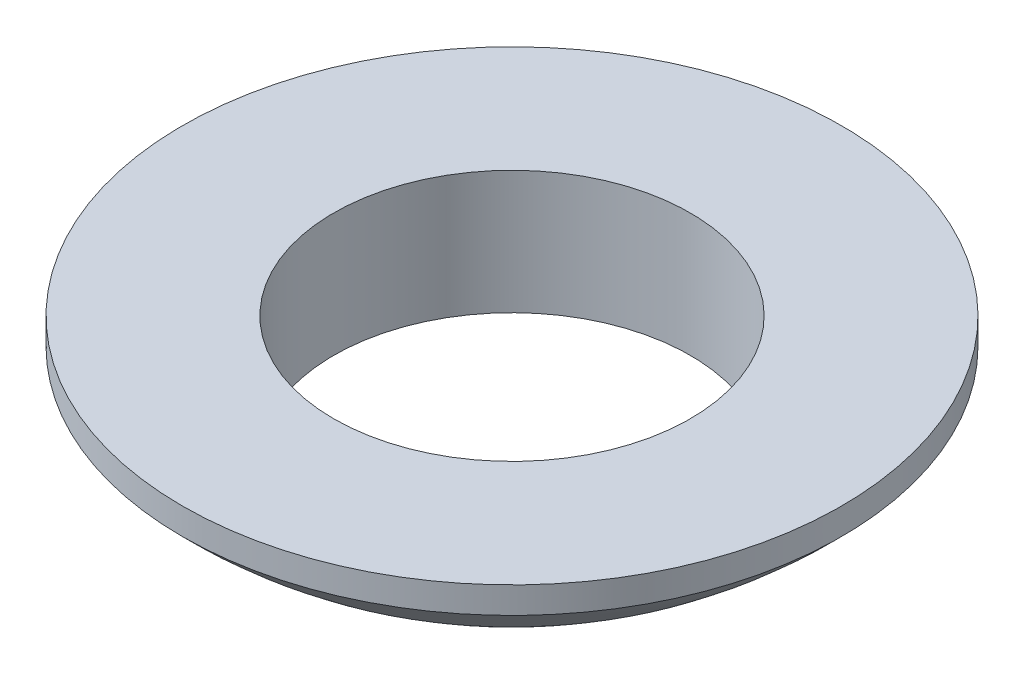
ISO-10303-21;
HEADER;
FILE_DESCRIPTION(('STEP AP214'),'2;1');
FILE_NAME('part.step','',(''),(''),'','','');
FILE_SCHEMA(('AUTOMOTIVE_DESIGN { 1 0 10303 214 1 1 1 1 }'));
ENDSEC;
DATA;
#1=APPLICATION_CONTEXT('core data for automotive mechanical design processes');
#2=APPLICATION_PROTOCOL_DEFINITION('international standard','automotive_design',2000,#1);
#3=PRODUCT_CONTEXT('',#1,'mechanical');
#4=PRODUCT('Part','Part','',(#3));
#5=PRODUCT_RELATED_PRODUCT_CATEGORY('part','',(#4));
#6=PRODUCT_DEFINITION_FORMATION('','',#4);
#7=PRODUCT_DEFINITION_CONTEXT('part definition',#1,'design');
#8=PRODUCT_DEFINITION('design','',#6,#7);
#9=PRODUCT_DEFINITION_SHAPE('','',#8);
#10=(LENGTH_UNIT() NAMED_UNIT(*) SI_UNIT(.MILLI.,.METRE.));
#11=(NAMED_UNIT(*) PLANE_ANGLE_UNIT() SI_UNIT($,.RADIAN.));
#12=(NAMED_UNIT(*) SI_UNIT($,.STERADIAN.) SOLID_ANGLE_UNIT());
#13=UNCERTAINTY_MEASURE_WITH_UNIT(LENGTH_MEASURE(1.E-05),#10,'distance_accuracy_value','');
#14=(GEOMETRIC_REPRESENTATION_CONTEXT(3) GLOBAL_UNCERTAINTY_ASSIGNED_CONTEXT((#13)) GLOBAL_UNIT_ASSIGNED_CONTEXT((#10,
#11,#12)) REPRESENTATION_CONTEXT('',''));
#15=CARTESIAN_POINT('',(0.,0.,0.));
#16=DIRECTION('',(0.,0.,1.));
#17=DIRECTION('',(1.,0.,0.));
#18=AXIS2_PLACEMENT_3D('',#15,#16,#17);
#19=CARTESIAN_POINT('',(474.940237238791,265.57848191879,0.));
#20=DIRECTION('',(0.,1.,0.));
#21=DIRECTION('',(0.,0.,1.));
#22=AXIS2_PLACEMENT_3D('',#19,#20,#21);
#23=CYLINDRICAL_SURFACE('',#22,11.7540252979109);
#24=CARTESIAN_POINT('',(474.940237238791,266.963953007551,0.));
#25=DIRECTION('',(0.,1.,0.));
#26=DIRECTION('',(0.,0.,1.));
#27=AXIS2_PLACEMENT_3D('',#24,#25,#26);
#28=CIRCLE('',#27,11.7540252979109);
#29=CARTESIAN_POINT('',(463.18621194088,266.963953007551,0.));
#30=VERTEX_POINT('',#29);
#31=EDGE_CURVE('E49',#30,#30,#28,.T.);
#32=ORIENTED_EDGE('',*,*,#31,.T.);
#33=EDGE_LOOP('',(#32));
#34=FACE_BOUND('',#33,.T.);
#35=CARTESIAN_POINT('',(474.940237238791,267.908370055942,0.));
#36=DIRECTION('',(0.,1.,0.));
#37=DIRECTION('',(0.,0.,1.));
#38=AXIS2_PLACEMENT_3D('',#35,#36,#37);
#39=CIRCLE('',#38,11.7540252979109);
#40=CARTESIAN_POINT('',(474.940237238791,267.908370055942,11.7540252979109));
#41=VERTEX_POINT('',#40);
#42=EDGE_CURVE('E10',#41,#41,#39,.T.);
#43=ORIENTED_EDGE('',*,*,#42,.F.);
#44=EDGE_LOOP('',(#43));
#45=FACE_BOUND('',#44,.T.);
#46=ADVANCED_FACE('F30',(#34,#45),#23,.T.);
#47=CARTESIAN_POINT('',(463.18621194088,267.908370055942,0.));
#48=DIRECTION('',(0.,1.,0.));
#49=DIRECTION('',(0.,0.,1.));
#50=AXIS2_PLACEMENT_3D('',#47,#48,#49);
#51=PLANE('',#50);
#52=ORIENTED_EDGE('',*,*,#42,.T.);
#53=EDGE_LOOP('',(#52));
#54=FACE_BOUND('',#53,.T.);
#55=CARTESIAN_POINT('',(474.940237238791,267.908370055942,0.));
#56=DIRECTION('',(0.,1.,0.));
#57=DIRECTION('',(0.,0.,1.));
#58=AXIS2_PLACEMENT_3D('',#55,#56,#57);
#59=CIRCLE('',#58,6.35999999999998);
#60=CARTESIAN_POINT('',(474.940237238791,267.908370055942,6.35999999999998));
#61=VERTEX_POINT('',#60);
#62=EDGE_CURVE('E36',#61,#61,#59,.T.);
#63=ORIENTED_EDGE('',*,*,#62,.F.);
#64=EDGE_LOOP('',(#63));
#65=FACE_BOUND('',#64,.T.);
#66=ADVANCED_FACE('F67',(#54,#65),#51,.T.);
#67=CARTESIAN_POINT('',(474.940237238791,265.57848191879,0.));
#68=DIRECTION('',(0.,1.,0.));
#69=DIRECTION('',(0.,0.,1.));
#70=AXIS2_PLACEMENT_3D('',#67,#68,#69);
#71=CYLINDRICAL_SURFACE('',#70,6.35999999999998);
#72=ORIENTED_EDGE('',*,*,#62,.T.);
#73=EDGE_LOOP('',(#72));
#74=FACE_BOUND('',#73,.T.);
#75=CARTESIAN_POINT('',(474.940237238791,263.508370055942,0.));
#76=DIRECTION('',(0.,1.,0.));
#77=DIRECTION('',(0.,0.,1.));
#78=AXIS2_PLACEMENT_3D('',#75,#76,#77);
#79=CIRCLE('',#78,6.35999999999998);
#80=CARTESIAN_POINT('',(474.940237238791,263.508370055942,6.35999999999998));
#81=VERTEX_POINT('',#80);
#82=EDGE_CURVE('E40',#81,#81,#79,.T.);
#83=ORIENTED_EDGE('',*,*,#82,.F.);
#84=EDGE_LOOP('',(#83));
#85=FACE_BOUND('',#84,.T.);
#86=ADVANCED_FACE('F63',(#74,#85),#71,.F.);
#87=CARTESIAN_POINT('',(467.978879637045,263.508370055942,0.));
#88=DIRECTION('',(0.,-1.,0.));
#89=DIRECTION('',(0.,0.,-1.));
#90=AXIS2_PLACEMENT_3D('',#87,#88,#89);
#91=PLANE('',#90);
#92=ORIENTED_EDGE('',*,*,#82,.T.);
#93=EDGE_LOOP('',(#92));
#94=FACE_BOUND('',#93,.T.);
#95=CARTESIAN_POINT('',(474.940237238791,263.508370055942,0.));
#96=DIRECTION('',(0.,1.,0.));
#97=DIRECTION('',(0.,0.,1.));
#98=AXIS2_PLACEMENT_3D('',#95,#96,#97);
#99=CIRCLE('',#98,6.96135760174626);
#100=CARTESIAN_POINT('',(467.978879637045,263.508370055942,0.));
#101=VERTEX_POINT('',#100);
#102=EDGE_CURVE('E44',#101,#101,#99,.T.);
#103=ORIENTED_EDGE('',*,*,#102,.F.);
#104=EDGE_LOOP('',(#103));
#105=FACE_BOUND('',#104,.T.);
#106=ADVANCED_FACE('F57',(#94,#105),#91,.T.);
#107=CARTESIAN_POINT('',(474.940237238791,278.214667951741,0.));
#108=DIRECTION('',(0.,1.,0.));
#109=DIRECTION('',(-1.,0.,0.));
#110=AXIS2_PLACEMENT_3D('',#107,#108,#109);
#111=SPHERICAL_SURFACE('',#110,16.2707005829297);
#112=CARTESIAN_POINT('',(467.978879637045,263.508370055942,0.));
#113=CARTESIAN_POINT('',(467.922939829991,263.534849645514,0.));
#114=CARTESIAN_POINT('',(467.867151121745,263.561648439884,0.));
#115=CARTESIAN_POINT('',(467.755883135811,263.615880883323,0.));
#116=CARTESIAN_POINT('',(467.700403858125,263.643314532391,0.));
#117=CARTESIAN_POINT('',(467.589761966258,263.698813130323,0.));
#118=CARTESIAN_POINT('',(467.534599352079,263.726878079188,0.));
#119=CARTESIAN_POINT('',(467.424597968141,263.783635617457,0.));
#120=CARTESIAN_POINT('',(467.369759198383,263.812328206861,0.));
#121=CARTESIAN_POINT('',(467.260412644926,263.870337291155,0.));
#122=CARTESIAN_POINT('',(467.205904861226,263.899653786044,0.));
#123=CARTESIAN_POINT('',(467.097227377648,263.95890686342,0.));
#124=CARTESIAN_POINT('',(467.043057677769,263.988843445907,0.));
#125=CARTESIAN_POINT('',(466.935063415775,264.04933280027,0.));
#126=CARTESIAN_POINT('',(466.881238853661,264.079885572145,0.));
#127=CARTESIAN_POINT('',(466.773941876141,264.141603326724,0.));
#128=CARTESIAN_POINT('',(466.720469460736,264.172768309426,0.));
#129=CARTESIAN_POINT('',(466.61388373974,264.235706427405,0.));
#130=CARTESIAN_POINT('',(466.560770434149,264.267479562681,0.));
#131=CARTESIAN_POINT('',(466.454909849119,264.331629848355,0.));
#132=CARTESIAN_POINT('',(466.402162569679,264.364006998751,0.));
#133=CARTESIAN_POINT('',(466.297040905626,264.429361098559,0.));
#134=CARTESIAN_POINT('',(466.244666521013,264.462338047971,0.));
#135=CARTESIAN_POINT('',(466.14029746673,264.528887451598,0.));
#136=CARTESIAN_POINT('',(466.08830279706,264.562459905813,0.));
#137=CARTESIAN_POINT('',(465.984699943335,264.63019594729,0.));
#138=CARTESIAN_POINT('',(465.93309175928,264.664359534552,0.));
#139=CARTESIAN_POINT('',(465.830268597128,264.73327339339,0.));
#140=CARTESIAN_POINT('',(465.779053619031,264.768023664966,0.));
#141=CARTESIAN_POINT('',(465.677023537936,264.838106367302,0.));
#142=CARTESIAN_POINT('',(465.626208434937,264.873438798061,0.));
#143=CARTESIAN_POINT('',(465.524984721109,264.944681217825,0.));
#144=CARTESIAN_POINT('',(465.47457611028,264.98059120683,0.));
#145=CARTESIAN_POINT('',(465.374171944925,265.052984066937,0.));
#146=CARTESIAN_POINT('',(465.324176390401,265.08946693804,0.));
#147=CARTESIAN_POINT('',(465.224604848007,265.163000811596,0.));
#148=CARTESIAN_POINT('',(465.175028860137,265.200051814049,0.));
#149=CARTESIAN_POINT('',(465.076302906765,265.274717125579,0.));
#150=CARTESIAN_POINT('',(465.027152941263,265.312331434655,0.));
#151=CARTESIAN_POINT('',(464.929285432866,265.388118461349,0.));
#152=CARTESIAN_POINT('',(464.880567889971,265.426291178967,0.));
#153=CARTESIAN_POINT('',(464.783571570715,265.503190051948,0.));
#154=CARTESIAN_POINT('',(464.735292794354,265.541916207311,0.));
#155=CARTESIAN_POINT('',(464.639180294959,265.619916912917,0.));
#156=CARTESIAN_POINT('',(464.591346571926,265.659191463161,0.));
#157=CARTESIAN_POINT('',(464.496130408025,265.738283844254,0.));
#158=CARTESIAN_POINT('',(464.448747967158,265.778101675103,0.));
#159=CARTESIAN_POINT('',(464.354440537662,265.858275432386,0.));
#160=CARTESIAN_POINT('',(464.307515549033,265.89863135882,0.));
#161=CARTESIAN_POINT('',(464.214129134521,265.979876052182,0.));
#162=CARTESIAN_POINT('',(464.167667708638,266.020764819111,0.));
#163=CARTESIAN_POINT('',(464.075214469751,266.103069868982,0.));
#164=CARTESIAN_POINT('',(464.029222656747,266.144486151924,0.));
#165=CARTESIAN_POINT('',(463.937714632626,266.227840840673,0.));
#166=CARTESIAN_POINT('',(463.892198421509,266.269779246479,0.));
#167=CARTESIAN_POINT('',(463.801647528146,266.354172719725,0.));
#168=CARTESIAN_POINT('',(463.7566128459,266.396627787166,0.));
#169=CARTESIAN_POINT('',(463.667030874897,266.482049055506,0.));
#170=CARTESIAN_POINT('',(463.62248358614,266.525015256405,0.));
#171=CARTESIAN_POINT('',(463.533882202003,266.611453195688,0.));
#172=CARTESIAN_POINT('',(463.489828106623,266.654924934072,0.));
#173=CARTESIAN_POINT('',(463.40221884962,266.742368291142,0.));
#174=CARTESIAN_POINT('',(463.358663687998,266.786339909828,0.));
#175=CARTESIAN_POINT('',(463.272057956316,266.874777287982,0.));
#176=CARTESIAN_POINT('',(463.229007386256,266.91924304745,0.));
#177=CARTESIAN_POINT('',(463.18621194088,266.963953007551,0.));
#178=B_SPLINE_CURVE_WITH_KNOTS('',3,(#112,#113,#114,#115,#116,#117,#118,#119,#120,#121,#122,
#123,#124,#125,#126,#127,#128,#129,#130,#131,#132,#133,#134,#135,#136,#137,#138,#139,#140,#141,
#142,#143,#144,#145,#146,#147,#148,#149,#150,#151,#152,#153,#154,#155,#156,#157,#158,#159,#160,
#161,#162,#163,#164,#165,#166,#167,#168,#169,#170,#171,#172,#173,#174,#175,#176,#177),
.UNSPECIFIED.,.F.,.F.,(4,2,2,2,2,2,2,2,2,2,2,2,2,2,2,2,2,2,2,2,2,2,2,2,2,2,2,2,2,2,2,2,4),(0.,
0.18567041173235,0.371340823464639,0.55701123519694,0.742681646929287,0.928352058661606,
1.11402247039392,1.29969288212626,1.48536329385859,1.6710337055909,1.85670411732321,
2.04237452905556,2.22804494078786,2.41371535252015,2.59938576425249,2.78505617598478,
2.97072658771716,3.15639699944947,3.34206741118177,3.52773782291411,3.71340823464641,
3.89907864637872,4.08474905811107,4.27041946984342,4.45608988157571,4.64176029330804,
4.82743070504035,5.01310111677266,5.19877152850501,5.3844419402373,5.57011235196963,
5.75578276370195,5.94145317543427),.UNSPECIFIED.);
#179=EDGE_CURVE('BSEAM55',#101,#30,#178,.T.);
#180=ORIENTED_EDGE('',*,*,#102,.T.);
#181=ORIENTED_EDGE('',*,*,#31,.F.);
#182=ORIENTED_EDGE('',*,*,#179,.T.);
#183=ORIENTED_EDGE('',*,*,#179,.F.);
#184=EDGE_LOOP('',(#180,#182,#181,#183));
#185=FACE_BOUND('',#184,.T.);
#186=ADVANCED_FACE('F55',(#185),#111,.T.);
#187=CLOSED_SHELL('',(#46,#66,#86,#106,#186));
#188=MANIFOLD_SOLID_BREP('B2',#187);
#189=ADVANCED_BREP_SHAPE_REPRESENTATION('',(#18,#188),#14);
#190=SHAPE_DEFINITION_REPRESENTATION(#9,#189);
ENDSEC;
END-ISO-10303-21;
